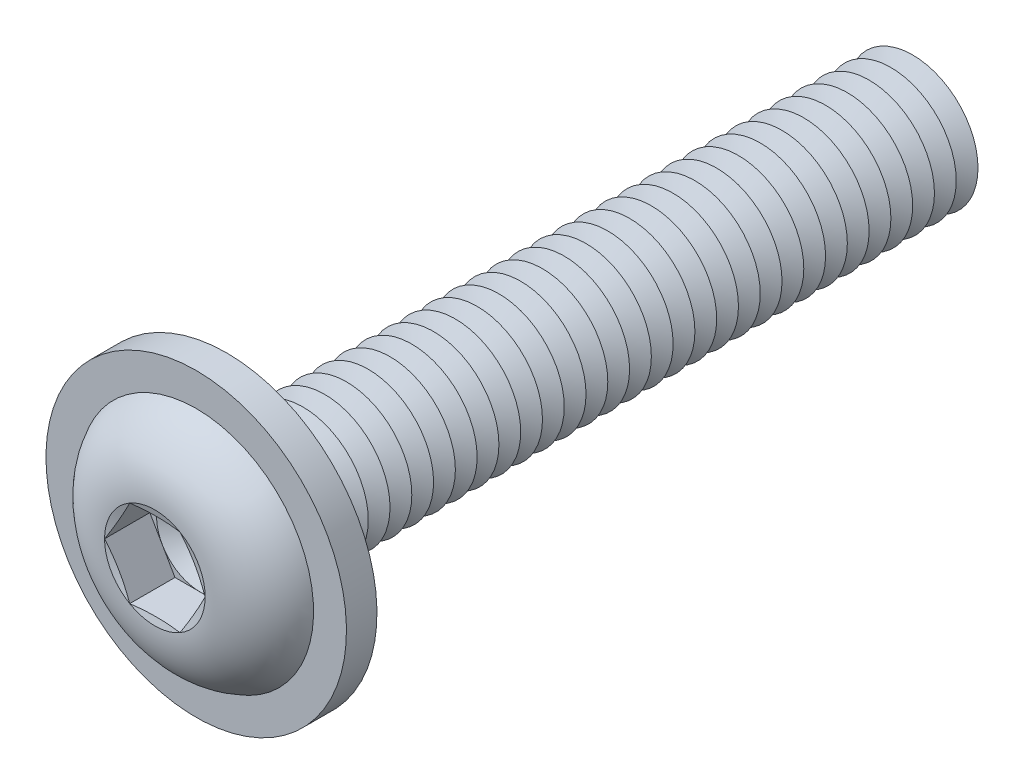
from build123d import *

# Parameters (mm, degrees)
FILLET1_R           = 0.25
LPATTERN1_COUNT     = 32
LPATTERN1_PITCH     = 0.5
CUT_EXTRUDE1_DEPTH  = 1.04
SKETCH5_R           = 3.45
SKETCH5_R_2         = 1.75
BOSS_EXTRUDE1_DEPTH = 0.7


with BuildPart() as part:
    # Sketch1 → Revolve1 (revolve)
    with BuildSketch(Plane(origin=(0, 0, 0), x_dir=(0, 0, -1), z_dir=(1, 0, 0)), mode=Mode.PRIVATE) as revolve1_sk:
        with BuildLine():
            Line((0, 1.5), (0, 2.85))
            ThreePointArc((0, 2.85), (-1.182850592, 2.35063849), (-1.65, 1.1547))
            Line((-1.65, 1.1547), (-1.495299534, 0.57735))
            Line((-1.495299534, 0.57735), (-1.65, 0.57735))
            Line((-1.65, 0.57735), (-1.65, 0))
            Line((-1.65, 0), (16, 0))
            Line((16, 0), (16, 1.5))
            Line((16, 1.5), (0, 1.5))
        make_face()
    revolve(revolve1_sk.sketch.rotate(Axis((0, 0, -16), (0, 0, 1)), 90), axis=Axis((0, 0, -16), (0, 0, 1)))

    # Fillet1
    fillet1_edges = [part.edges().sort_by_distance(p)[0] for p in [
        (1.5, 0, 0),
    ]]
    fillet(fillet1_edges, radius=FILLET1_R)

    # Sketch2 → Cut-Revolve1 (revolve, cut)
    with BuildSketch(Plane(origin=(0, 0, 0), x_dir=(0, 0, -1), z_dir=(1, 0, 0)), mode=Mode.PRIVATE) as cut_revolve1_sk:
        Polygon((15.75, 1.5), (16.25, 1.5), (16, 1.066987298), align=None)
    cut_revolve1 = revolve(cut_revolve1_sk.sketch.rotate(Axis((0, 0, -16), (0, 0, -1)), 270), axis=Axis((0, 0, -16), (0, 0, -1)), mode=Mode.SUBTRACT)

    # LPattern1: Cut-Revolve1 ×32
    with Locations(*[(0, 0, i * LPATTERN1_PITCH) for i in range(1, LPATTERN1_COUNT)]):
        add(cut_revolve1, mode=Mode.SUBTRACT)

    # Sketch3 → Cut-Extrude1 (cut)
    with BuildSketch(Plane.XY.offset(1.65)):
        Polygon((0.57735, 0.999999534), (-0.57735, 0.999999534), (-1.1547, 0), (-0.57735, -0.999999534), (0.57735, -0.999999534), (1.1547, 0), align=None)
    extrude(amount=-CUT_EXTRUDE1_DEPTH, mode=Mode.SUBTRACT)

    # Cut-Extrude2 cone 1 section (on through the dimple's axis) → Cut-Extrude2 (revolve, cut)
    with BuildSketch(Plane(origin=(0, 0, 0.61), x_dir=(0, -1, 0), z_dir=(1, 0, 0))):
        Polygon((0, 0), (0.999999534, 0), (0, 0.57735), align=None)
    revolve(axis=Axis((0, 0, 0.61), (0, 0, -1)), mode=Mode.SUBTRACT)

    # Sketch5 → Boss-Extrude1 (add)
    with BuildSketch(Plane(origin=(0, 0, 0), x_dir=(-1, 0, 0), z_dir=(0, 0, -1))):
        with Locations(Location((0, 0, 0), (0, 0, 90))):
            Circle(SKETCH5_R)
        Circle(SKETCH5_R_2, mode=Mode.SUBTRACT)
    extrude(amount=-BOSS_EXTRUDE1_DEPTH)


solid = part.part
